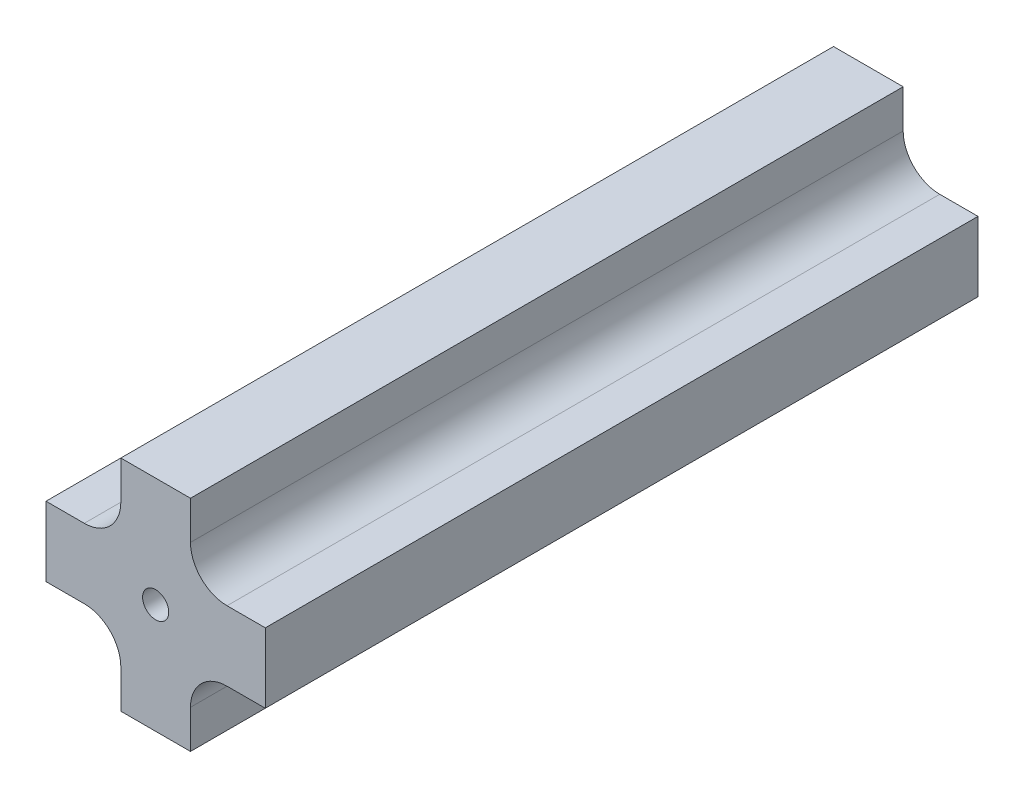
ISO-10303-21;
HEADER;
FILE_DESCRIPTION(('STEP AP214'),'2;1');
FILE_NAME('part.step','',(''),(''),'','','');
FILE_SCHEMA(('AUTOMOTIVE_DESIGN { 1 0 10303 214 1 1 1 1 }'));
ENDSEC;
DATA;
#1=APPLICATION_CONTEXT('core data for automotive mechanical design processes');
#2=APPLICATION_PROTOCOL_DEFINITION('international standard','automotive_design',2000,#1);
#3=PRODUCT_CONTEXT('',#1,'mechanical');
#4=PRODUCT('Part','Part','',(#3));
#5=PRODUCT_RELATED_PRODUCT_CATEGORY('part','',(#4));
#6=PRODUCT_DEFINITION_FORMATION('','',#4);
#7=PRODUCT_DEFINITION_CONTEXT('part definition',#1,'design');
#8=PRODUCT_DEFINITION('design','',#6,#7);
#9=PRODUCT_DEFINITION_SHAPE('','',#8);
#10=(LENGTH_UNIT() NAMED_UNIT(*) SI_UNIT(.MILLI.,.METRE.));
#11=(NAMED_UNIT(*) PLANE_ANGLE_UNIT() SI_UNIT($,.RADIAN.));
#12=(NAMED_UNIT(*) SI_UNIT($,.STERADIAN.) SOLID_ANGLE_UNIT());
#13=UNCERTAINTY_MEASURE_WITH_UNIT(LENGTH_MEASURE(1.E-05),#10,'distance_accuracy_value','');
#14=(GEOMETRIC_REPRESENTATION_CONTEXT(3) GLOBAL_UNCERTAINTY_ASSIGNED_CONTEXT((#13)) GLOBAL_UNIT_ASSIGNED_CONTEXT((#10,
#11,#12)) REPRESENTATION_CONTEXT('',''));
#15=CARTESIAN_POINT('',(0.,0.,0.));
#16=DIRECTION('',(0.,0.,1.));
#17=DIRECTION('',(1.,0.,0.));
#18=AXIS2_PLACEMENT_3D('',#15,#16,#17);
#19=CARTESIAN_POINT('',(26.0427427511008,-26.0427427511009,260.));
#20=DIRECTION('',(0.,0.,1.));
#21=DIRECTION('',(1.,0.,0.));
#22=AXIS2_PLACEMENT_3D('',#19,#20,#21);
#23=PLANE('',#22);
#24=CARTESIAN_POINT('',(26.0427427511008,-26.0427427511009,260.));
#25=DIRECTION('',(0.,0.,-1.));
#26=DIRECTION('',(1.,0.,0.));
#27=AXIS2_PLACEMENT_3D('',#24,#25,#26);
#28=CIRCLE('',#27,13.3358602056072);
#29=CARTESIAN_POINT('',(12.706882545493,-26.0427427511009,260.));
#30=VERTEX_POINT('',#29);
#31=CARTESIAN_POINT('',(26.0427427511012,-12.7068825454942,260.));
#32=VERTEX_POINT('',#31);
#33=EDGE_CURVE('E207',#30,#32,#28,.T.);
#34=ORIENTED_EDGE('',*,*,#33,.T.);
#35=DIRECTION('',(1.,0.,0.));
#36=VECTOR('',#35,1.);
#37=CARTESIAN_POINT('',(26.0427427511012,-12.7068825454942,260.));
#38=LINE('',#37,#36);
#39=CARTESIAN_POINT('',(40.005,-12.7068825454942,260.));
#40=VERTEX_POINT('',#39);
#41=EDGE_CURVE('E115',#32,#40,#38,.T.);
#42=ORIENTED_EDGE('',*,*,#41,.T.);
#43=DIRECTION('',(0.,1.,0.));
#44=VECTOR('',#43,1.);
#45=CARTESIAN_POINT('',(40.005,-12.7068825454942,260.));
#46=LINE('',#45,#44);
#47=CARTESIAN_POINT('',(40.005,12.7068825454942,260.));
#48=VERTEX_POINT('',#47);
#49=EDGE_CURVE('E246',#40,#48,#46,.T.);
#50=ORIENTED_EDGE('',*,*,#49,.T.);
#51=DIRECTION('',(-1.,0.,0.));
#52=VECTOR('',#51,1.);
#53=CARTESIAN_POINT('',(40.005,12.7068825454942,260.));
#54=LINE('',#53,#52);
#55=CARTESIAN_POINT('',(26.0427427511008,12.7068825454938,260.));
#56=VERTEX_POINT('',#55);
#57=EDGE_CURVE('E265',#48,#56,#54,.T.);
#58=ORIENTED_EDGE('',*,*,#57,.T.);
#59=CARTESIAN_POINT('',(26.0427427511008,26.0427427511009,260.));
#60=DIRECTION('',(0.,0.,-1.));
#61=DIRECTION('',(1.,0.,0.));
#62=AXIS2_PLACEMENT_3D('',#59,#60,#61);
#63=CIRCLE('',#62,13.3358602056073);
#64=CARTESIAN_POINT('',(12.7068825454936,26.0427427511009,260.));
#65=VERTEX_POINT('',#64);
#66=EDGE_CURVE('E262',#56,#65,#63,.T.);
#67=ORIENTED_EDGE('',*,*,#66,.T.);
#68=DIRECTION('',(0.,1.,0.));
#69=VECTOR('',#68,1.);
#70=CARTESIAN_POINT('',(12.7068825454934,26.0427427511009,260.));
#71=LINE('',#70,#69);
#72=CARTESIAN_POINT('',(12.7068825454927,40.005,260.));
#73=VERTEX_POINT('',#72);
#74=EDGE_CURVE('E264',#65,#73,#71,.T.);
#75=ORIENTED_EDGE('',*,*,#74,.T.);
#76=DIRECTION('',(-1.,0.,0.));
#77=VECTOR('',#76,1.);
#78=CARTESIAN_POINT('',(12.7068825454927,40.005,260.));
#79=LINE('',#78,#77);
#80=CARTESIAN_POINT('',(-12.7068825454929,40.005,260.));
#81=VERTEX_POINT('',#80);
#82=EDGE_CURVE('E267',#73,#81,#79,.T.);
#83=ORIENTED_EDGE('',*,*,#82,.T.);
#84=DIRECTION('',(0.,-1.,0.));
#85=VECTOR('',#84,1.);
#86=CARTESIAN_POINT('',(-12.7068825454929,40.005,260.));
#87=LINE('',#86,#85);
#88=CARTESIAN_POINT('',(-12.7068825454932,26.0427427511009,260.));
#89=VERTEX_POINT('',#88);
#90=EDGE_CURVE('E273',#81,#89,#87,.T.);
#91=ORIENTED_EDGE('',*,*,#90,.T.);
#92=CARTESIAN_POINT('',(-26.042742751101,26.0427427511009,260.));
#93=DIRECTION('',(0.,0.,-1.));
#94=DIRECTION('',(1.,0.,0.));
#95=AXIS2_PLACEMENT_3D('',#92,#93,#94);
#96=CIRCLE('',#95,13.3358602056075);
#97=CARTESIAN_POINT('',(-26.042742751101,12.7068825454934,260.));
#98=VERTEX_POINT('',#97);
#99=EDGE_CURVE('E275',#89,#98,#96,.T.);
#100=ORIENTED_EDGE('',*,*,#99,.T.);
#101=DIRECTION('',(-1.,0.,0.));
#102=VECTOR('',#101,1.);
#103=CARTESIAN_POINT('',(-26.042742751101,12.7068825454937,260.));
#104=LINE('',#103,#102);
#105=CARTESIAN_POINT('',(-40.005,12.7068825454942,260.));
#106=VERTEX_POINT('',#105);
#107=EDGE_CURVE('E277',#98,#106,#104,.T.);
#108=ORIENTED_EDGE('',*,*,#107,.T.);
#109=DIRECTION('',(0.,-1.,0.));
#110=VECTOR('',#109,1.);
#111=CARTESIAN_POINT('',(-40.005,12.7068825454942,260.));
#112=LINE('',#111,#110);
#113=CARTESIAN_POINT('',(-40.005,-12.7068825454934,260.));
#114=VERTEX_POINT('',#113);
#115=EDGE_CURVE('E279',#106,#114,#112,.T.);
#116=ORIENTED_EDGE('',*,*,#115,.T.);
#117=DIRECTION('',(1.,0.,0.));
#118=VECTOR('',#117,1.);
#119=CARTESIAN_POINT('',(-40.005,-12.7068825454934,260.));
#120=LINE('',#119,#118);
#121=CARTESIAN_POINT('',(-26.042742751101,-12.7068825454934,260.));
#122=VERTEX_POINT('',#121);
#123=EDGE_CURVE('E281',#114,#122,#120,.T.);
#124=ORIENTED_EDGE('',*,*,#123,.T.);
#125=CARTESIAN_POINT('',(-26.042742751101,-26.0427427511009,260.));
#126=DIRECTION('',(0.,0.,-1.));
#127=DIRECTION('',(1.,0.,0.));
#128=AXIS2_PLACEMENT_3D('',#125,#126,#127);
#129=CIRCLE('',#128,13.3358602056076);
#130=CARTESIAN_POINT('',(-12.7068825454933,-26.0427427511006,260.));
#131=VERTEX_POINT('',#130);
#132=EDGE_CURVE('E158',#122,#131,#129,.T.);
#133=ORIENTED_EDGE('',*,*,#132,.T.);
#134=DIRECTION('',(0.,-1.,0.));
#135=VECTOR('',#134,1.);
#136=CARTESIAN_POINT('',(-12.7068825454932,-26.0427427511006,260.));
#137=LINE('',#136,#135);
#138=CARTESIAN_POINT('',(-12.7068825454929,-40.005,260.));
#139=VERTEX_POINT('',#138);
#140=EDGE_CURVE('E152',#131,#139,#137,.T.);
#141=ORIENTED_EDGE('',*,*,#140,.T.);
#142=DIRECTION('',(1.,0.,0.));
#143=VECTOR('',#142,1.);
#144=CARTESIAN_POINT('',(-12.7068825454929,-40.005,260.));
#145=LINE('',#144,#143);
#146=CARTESIAN_POINT('',(12.7068825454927,-40.005,260.));
#147=VERTEX_POINT('',#146);
#148=EDGE_CURVE('E156',#139,#147,#145,.T.);
#149=ORIENTED_EDGE('',*,*,#148,.T.);
#150=DIRECTION('',(0.,1.,0.));
#151=VECTOR('',#150,1.);
#152=CARTESIAN_POINT('',(12.7068825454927,-40.005,260.));
#153=LINE('',#152,#151);
#154=EDGE_CURVE('E48',#147,#30,#153,.T.);
#155=ORIENTED_EDGE('',*,*,#154,.T.);
#156=EDGE_LOOP('',(#34,#42,#50,#58,#67,#75,#83,#91,#100,#108,#116,#124,#133,#141,#149,#155));
#157=FACE_BOUND('',#156,.T.);
#158=CARTESIAN_POINT('',(0.,0.,260.));
#159=DIRECTION('',(0.,0.,1.));
#160=DIRECTION('',(1.,0.,0.));
#161=AXIS2_PLACEMENT_3D('',#158,#159,#160);
#162=CIRCLE('',#161,4.7625);
#163=CARTESIAN_POINT('',(4.7625,0.,260.));
#164=VERTEX_POINT('',#163);
#165=EDGE_CURVE('E180',#164,#164,#162,.T.);
#166=ORIENTED_EDGE('',*,*,#165,.F.);
#167=EDGE_LOOP('',(#166));
#168=FACE_BOUND('',#167,.T.);
#169=ADVANCED_FACE('F31',(#157,#168),#23,.T.);
#170=CARTESIAN_POINT('',(26.0427427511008,-26.0427427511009,0.));
#171=DIRECTION('',(0.,0.,1.));
#172=DIRECTION('',(1.,0.,0.));
#173=AXIS2_PLACEMENT_3D('',#170,#171,#172);
#174=PLANE('',#173);
#175=CARTESIAN_POINT('',(26.0427427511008,-26.0427427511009,0.));
#176=DIRECTION('',(0.,0.,-1.));
#177=DIRECTION('',(1.,0.,0.));
#178=AXIS2_PLACEMENT_3D('',#175,#176,#177);
#179=CIRCLE('',#178,13.3358602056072);
#180=CARTESIAN_POINT('',(12.706882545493,-26.0427427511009,0.));
#181=VERTEX_POINT('',#180);
#182=CARTESIAN_POINT('',(26.0427427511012,-12.7068825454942,0.));
#183=VERTEX_POINT('',#182);
#184=EDGE_CURVE('E176',#181,#183,#179,.T.);
#185=ORIENTED_EDGE('',*,*,#184,.F.);
#186=DIRECTION('',(0.,1.,0.));
#187=VECTOR('',#186,1.);
#188=CARTESIAN_POINT('',(12.7068825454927,-40.005,0.));
#189=LINE('',#188,#187);
#190=CARTESIAN_POINT('',(12.7068825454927,-40.005,0.));
#191=VERTEX_POINT('',#190);
#192=EDGE_CURVE('E107',#191,#181,#189,.T.);
#193=ORIENTED_EDGE('',*,*,#192,.F.);
#194=DIRECTION('',(1.,0.,0.));
#195=VECTOR('',#194,1.);
#196=CARTESIAN_POINT('',(-12.7068825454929,-40.005,0.));
#197=LINE('',#196,#195);
#198=CARTESIAN_POINT('',(-12.7068825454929,-40.005,0.));
#199=VERTEX_POINT('',#198);
#200=EDGE_CURVE('E101',#199,#191,#197,.T.);
#201=ORIENTED_EDGE('',*,*,#200,.F.);
#202=DIRECTION('',(0.,-1.,0.));
#203=VECTOR('',#202,1.);
#204=CARTESIAN_POINT('',(-12.7068825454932,-26.0427427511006,0.));
#205=LINE('',#204,#203);
#206=CARTESIAN_POINT('',(-12.7068825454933,-26.0427427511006,0.));
#207=VERTEX_POINT('',#206);
#208=EDGE_CURVE('E166',#207,#199,#205,.T.);
#209=ORIENTED_EDGE('',*,*,#208,.F.);
#210=CARTESIAN_POINT('',(-26.042742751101,-26.0427427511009,0.));
#211=DIRECTION('',(0.,0.,-1.));
#212=DIRECTION('',(1.,0.,0.));
#213=AXIS2_PLACEMENT_3D('',#210,#211,#212);
#214=CIRCLE('',#213,13.3358602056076);
#215=CARTESIAN_POINT('',(-26.042742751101,-12.7068825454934,0.));
#216=VERTEX_POINT('',#215);
#217=EDGE_CURVE('E202',#216,#207,#214,.T.);
#218=ORIENTED_EDGE('',*,*,#217,.F.);
#219=DIRECTION('',(1.,0.,0.));
#220=VECTOR('',#219,1.);
#221=CARTESIAN_POINT('',(-40.005,-12.7068825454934,0.));
#222=LINE('',#221,#220);
#223=CARTESIAN_POINT('',(-40.005,-12.7068825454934,0.));
#224=VERTEX_POINT('',#223);
#225=EDGE_CURVE('E200',#224,#216,#222,.T.);
#226=ORIENTED_EDGE('',*,*,#225,.F.);
#227=DIRECTION('',(0.,-1.,0.));
#228=VECTOR('',#227,1.);
#229=CARTESIAN_POINT('',(-40.005,12.7068825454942,0.));
#230=LINE('',#229,#228);
#231=CARTESIAN_POINT('',(-40.005,12.7068825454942,0.));
#232=VERTEX_POINT('',#231);
#233=EDGE_CURVE('E198',#232,#224,#230,.T.);
#234=ORIENTED_EDGE('',*,*,#233,.F.);
#235=DIRECTION('',(-1.,0.,0.));
#236=VECTOR('',#235,1.);
#237=CARTESIAN_POINT('',(-26.042742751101,12.7068825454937,0.));
#238=LINE('',#237,#236);
#239=CARTESIAN_POINT('',(-26.042742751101,12.7068825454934,0.));
#240=VERTEX_POINT('',#239);
#241=EDGE_CURVE('E196',#240,#232,#238,.T.);
#242=ORIENTED_EDGE('',*,*,#241,.F.);
#243=CARTESIAN_POINT('',(-26.042742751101,26.0427427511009,0.));
#244=DIRECTION('',(0.,0.,-1.));
#245=DIRECTION('',(1.,0.,0.));
#246=AXIS2_PLACEMENT_3D('',#243,#244,#245);
#247=CIRCLE('',#246,13.3358602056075);
#248=CARTESIAN_POINT('',(-12.7068825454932,26.0427427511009,0.));
#249=VERTEX_POINT('',#248);
#250=EDGE_CURVE('E194',#249,#240,#247,.T.);
#251=ORIENTED_EDGE('',*,*,#250,.F.);
#252=DIRECTION('',(0.,-1.,0.));
#253=VECTOR('',#252,1.);
#254=CARTESIAN_POINT('',(-12.7068825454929,40.005,0.));
#255=LINE('',#254,#253);
#256=CARTESIAN_POINT('',(-12.7068825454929,40.005,0.));
#257=VERTEX_POINT('',#256);
#258=EDGE_CURVE('E192',#257,#249,#255,.T.);
#259=ORIENTED_EDGE('',*,*,#258,.F.);
#260=DIRECTION('',(-1.,0.,0.));
#261=VECTOR('',#260,1.);
#262=CARTESIAN_POINT('',(12.7068825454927,40.005,0.));
#263=LINE('',#262,#261);
#264=CARTESIAN_POINT('',(12.7068825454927,40.005,0.));
#265=VERTEX_POINT('',#264);
#266=EDGE_CURVE('E190',#265,#257,#263,.T.);
#267=ORIENTED_EDGE('',*,*,#266,.F.);
#268=DIRECTION('',(0.,1.,0.));
#269=VECTOR('',#268,1.);
#270=CARTESIAN_POINT('',(12.7068825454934,26.0427427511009,0.));
#271=LINE('',#270,#269);
#272=CARTESIAN_POINT('',(12.7068825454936,26.0427427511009,0.));
#273=VERTEX_POINT('',#272);
#274=EDGE_CURVE('E188',#273,#265,#271,.T.);
#275=ORIENTED_EDGE('',*,*,#274,.F.);
#276=CARTESIAN_POINT('',(26.0427427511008,26.0427427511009,0.));
#277=DIRECTION('',(0.,0.,-1.));
#278=DIRECTION('',(1.,0.,0.));
#279=AXIS2_PLACEMENT_3D('',#276,#277,#278);
#280=CIRCLE('',#279,13.3358602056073);
#281=CARTESIAN_POINT('',(26.0427427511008,12.7068825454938,0.));
#282=VERTEX_POINT('',#281);
#283=EDGE_CURVE('E186',#282,#273,#280,.T.);
#284=ORIENTED_EDGE('',*,*,#283,.F.);
#285=DIRECTION('',(-1.,0.,0.));
#286=VECTOR('',#285,1.);
#287=CARTESIAN_POINT('',(40.005,12.7068825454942,0.));
#288=LINE('',#287,#286);
#289=CARTESIAN_POINT('',(40.005,12.7068825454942,0.));
#290=VERTEX_POINT('',#289);
#291=EDGE_CURVE('E184',#290,#282,#288,.T.);
#292=ORIENTED_EDGE('',*,*,#291,.F.);
#293=DIRECTION('',(0.,1.,0.));
#294=VECTOR('',#293,1.);
#295=CARTESIAN_POINT('',(40.005,-12.7068825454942,0.));
#296=LINE('',#295,#294);
#297=CARTESIAN_POINT('',(40.005,-12.7068825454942,0.));
#298=VERTEX_POINT('',#297);
#299=EDGE_CURVE('E182',#298,#290,#296,.T.);
#300=ORIENTED_EDGE('',*,*,#299,.F.);
#301=DIRECTION('',(1.,0.,0.));
#302=VECTOR('',#301,1.);
#303=CARTESIAN_POINT('',(26.0427427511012,-12.7068825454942,0.));
#304=LINE('',#303,#302);
#305=EDGE_CURVE('E179',#183,#298,#304,.T.);
#306=ORIENTED_EDGE('',*,*,#305,.F.);
#307=EDGE_LOOP('',(#185,#193,#201,#209,#218,#226,#234,#242,#251,#259,#267,#275,#284,#292,#300,#306));
#308=FACE_BOUND('',#307,.T.);
#309=CARTESIAN_POINT('',(0.,0.,0.));
#310=DIRECTION('',(0.,0.,1.));
#311=DIRECTION('',(1.,0.,0.));
#312=AXIS2_PLACEMENT_3D('',#309,#310,#311);
#313=CIRCLE('',#312,4.7625);
#314=CARTESIAN_POINT('',(4.7625,0.,0.));
#315=VERTEX_POINT('',#314);
#316=EDGE_CURVE('E480',#315,#315,#313,.T.);
#317=ORIENTED_EDGE('',*,*,#316,.T.);
#318=EDGE_LOOP('',(#317));
#319=FACE_BOUND('',#318,.T.);
#320=ADVANCED_FACE('F250',(#308,#319),#174,.F.);
#321=CARTESIAN_POINT('',(26.0427427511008,-26.0427427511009,260.));
#322=DIRECTION('',(0.,0.,-1.));
#323=DIRECTION('',(-1.,0.,0.));
#324=AXIS2_PLACEMENT_3D('',#321,#322,#323);
#325=CYLINDRICAL_SURFACE('',#324,13.3358602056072);
#326=ORIENTED_EDGE('',*,*,#184,.T.);
#327=DIRECTION('',(0.,0.,-1.));
#328=VECTOR('',#327,1.);
#329=CARTESIAN_POINT('',(26.0427427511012,-12.7068825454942,260.));
#330=LINE('',#329,#328);
#331=EDGE_CURVE('E11',#32,#183,#330,.T.);
#332=ORIENTED_EDGE('',*,*,#331,.F.);
#333=ORIENTED_EDGE('',*,*,#33,.F.);
#334=DIRECTION('',(0.,0.,-1.));
#335=VECTOR('',#334,1.);
#336=CARTESIAN_POINT('',(12.706882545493,-26.0427427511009,260.));
#337=LINE('',#336,#335);
#338=EDGE_CURVE('E172',#30,#181,#337,.T.);
#339=ORIENTED_EDGE('',*,*,#338,.T.);
#340=EDGE_LOOP('',(#326,#332,#333,#339));
#341=FACE_BOUND('',#340,.T.);
#342=ADVANCED_FACE('F33',(#341),#325,.F.);
#343=CARTESIAN_POINT('',(26.0427427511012,-12.7068825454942,260.));
#344=DIRECTION('',(0.,1.,0.));
#345=DIRECTION('',(-1.,0.,0.));
#346=AXIS2_PLACEMENT_3D('',#343,#344,#345);
#347=PLANE('',#346);
#348=ORIENTED_EDGE('',*,*,#305,.T.);
#349=DIRECTION('',(0.,0.,-1.));
#350=VECTOR('',#349,1.);
#351=CARTESIAN_POINT('',(40.005,-12.7068825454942,260.));
#352=LINE('',#351,#350);
#353=EDGE_CURVE('E40',#40,#298,#352,.T.);
#354=ORIENTED_EDGE('',*,*,#353,.F.);
#355=ORIENTED_EDGE('',*,*,#41,.F.);
#356=ORIENTED_EDGE('',*,*,#331,.T.);
#357=EDGE_LOOP('',(#348,#354,#355,#356));
#358=FACE_BOUND('',#357,.T.);
#359=ADVANCED_FACE('F315',(#358),#347,.F.);
#360=CARTESIAN_POINT('',(40.005,-12.7068825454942,260.));
#361=DIRECTION('',(-1.,0.,0.));
#362=DIRECTION('',(0.,0.,1.));
#363=AXIS2_PLACEMENT_3D('',#360,#361,#362);
#364=PLANE('',#363);
#365=ORIENTED_EDGE('',*,*,#299,.T.);
#366=DIRECTION('',(0.,0.,-1.));
#367=VECTOR('',#366,1.);
#368=CARTESIAN_POINT('',(40.005,12.7068825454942,260.));
#369=LINE('',#368,#367);
#370=EDGE_CURVE('E238',#48,#290,#369,.T.);
#371=ORIENTED_EDGE('',*,*,#370,.F.);
#372=ORIENTED_EDGE('',*,*,#49,.F.);
#373=ORIENTED_EDGE('',*,*,#353,.T.);
#374=EDGE_LOOP('',(#365,#371,#372,#373));
#375=FACE_BOUND('',#374,.T.);
#376=ADVANCED_FACE('F244',(#375),#364,.F.);
#377=CARTESIAN_POINT('',(40.005,12.7068825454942,260.));
#378=DIRECTION('',(0.,-1.,0.));
#379=DIRECTION('',(1.,0.,0.));
#380=AXIS2_PLACEMENT_3D('',#377,#378,#379);
#381=PLANE('',#380);
#382=ORIENTED_EDGE('',*,*,#291,.T.);
#383=DIRECTION('',(0.,0.,-1.));
#384=VECTOR('',#383,1.);
#385=CARTESIAN_POINT('',(26.0427427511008,12.7068825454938,260.));
#386=LINE('',#385,#384);
#387=EDGE_CURVE('E235',#56,#282,#386,.T.);
#388=ORIENTED_EDGE('',*,*,#387,.F.);
#389=ORIENTED_EDGE('',*,*,#57,.F.);
#390=ORIENTED_EDGE('',*,*,#370,.T.);
#391=EDGE_LOOP('',(#382,#388,#389,#390));
#392=FACE_BOUND('',#391,.T.);
#393=ADVANCED_FACE('F256',(#392),#381,.F.);
#394=CARTESIAN_POINT('',(26.0427427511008,26.0427427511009,260.));
#395=DIRECTION('',(0.,0.,-1.));
#396=DIRECTION('',(-1.,0.,0.));
#397=AXIS2_PLACEMENT_3D('',#394,#395,#396);
#398=CYLINDRICAL_SURFACE('',#397,13.3358602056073);
#399=ORIENTED_EDGE('',*,*,#283,.T.);
#400=DIRECTION('',(0.,0.,-1.));
#401=VECTOR('',#400,1.);
#402=CARTESIAN_POINT('',(12.7068825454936,26.0427427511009,260.));
#403=LINE('',#402,#401);
#404=EDGE_CURVE('E232',#65,#273,#403,.T.);
#405=ORIENTED_EDGE('',*,*,#404,.F.);
#406=ORIENTED_EDGE('',*,*,#66,.F.);
#407=ORIENTED_EDGE('',*,*,#387,.T.);
#408=EDGE_LOOP('',(#399,#405,#406,#407));
#409=FACE_BOUND('',#408,.T.);
#410=ADVANCED_FACE('F260',(#409),#398,.F.);
#411=CARTESIAN_POINT('',(12.7068825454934,26.0427427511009,260.));
#412=DIRECTION('',(-1.,0.,0.));
#413=DIRECTION('',(0.,-1.,0.));
#414=AXIS2_PLACEMENT_3D('',#411,#412,#413);
#415=PLANE('',#414);
#416=ORIENTED_EDGE('',*,*,#274,.T.);
#417=DIRECTION('',(0.,0.,-1.));
#418=VECTOR('',#417,1.);
#419=CARTESIAN_POINT('',(12.7068825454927,40.005,260.));
#420=LINE('',#419,#418);
#421=EDGE_CURVE('E229',#73,#265,#420,.T.);
#422=ORIENTED_EDGE('',*,*,#421,.F.);
#423=ORIENTED_EDGE('',*,*,#74,.F.);
#424=ORIENTED_EDGE('',*,*,#404,.T.);
#425=EDGE_LOOP('',(#416,#422,#423,#424));
#426=FACE_BOUND('',#425,.T.);
#427=ADVANCED_FACE('F328',(#426),#415,.F.);
#428=CARTESIAN_POINT('',(12.7068825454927,40.005,260.));
#429=DIRECTION('',(0.,-1.,0.));
#430=DIRECTION('',(0.,0.,-1.));
#431=AXIS2_PLACEMENT_3D('',#428,#429,#430);
#432=PLANE('',#431);
#433=ORIENTED_EDGE('',*,*,#266,.T.);
#434=DIRECTION('',(0.,0.,-1.));
#435=VECTOR('',#434,1.);
#436=CARTESIAN_POINT('',(-12.7068825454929,40.005,260.));
#437=LINE('',#436,#435);
#438=EDGE_CURVE('E226',#81,#257,#437,.T.);
#439=ORIENTED_EDGE('',*,*,#438,.F.);
#440=ORIENTED_EDGE('',*,*,#82,.F.);
#441=ORIENTED_EDGE('',*,*,#421,.T.);
#442=EDGE_LOOP('',(#433,#439,#440,#441));
#443=FACE_BOUND('',#442,.T.);
#444=ADVANCED_FACE('F331',(#443),#432,.F.);
#445=CARTESIAN_POINT('',(-12.7068825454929,40.005,260.));
#446=DIRECTION('',(1.,0.,0.));
#447=DIRECTION('',(0.,1.,0.));
#448=AXIS2_PLACEMENT_3D('',#445,#446,#447);
#449=PLANE('',#448);
#450=ORIENTED_EDGE('',*,*,#258,.T.);
#451=DIRECTION('',(0.,0.,-1.));
#452=VECTOR('',#451,1.);
#453=CARTESIAN_POINT('',(-12.7068825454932,26.0427427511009,260.));
#454=LINE('',#453,#452);
#455=EDGE_CURVE('E223',#89,#249,#454,.T.);
#456=ORIENTED_EDGE('',*,*,#455,.F.);
#457=ORIENTED_EDGE('',*,*,#90,.F.);
#458=ORIENTED_EDGE('',*,*,#438,.T.);
#459=EDGE_LOOP('',(#450,#456,#457,#458));
#460=FACE_BOUND('',#459,.T.);
#461=ADVANCED_FACE('F335',(#460),#449,.F.);
#462=CARTESIAN_POINT('',(-26.042742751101,26.0427427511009,260.));
#463=DIRECTION('',(0.,0.,-1.));
#464=DIRECTION('',(-1.,0.,0.));
#465=AXIS2_PLACEMENT_3D('',#462,#463,#464);
#466=CYLINDRICAL_SURFACE('',#465,13.3358602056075);
#467=ORIENTED_EDGE('',*,*,#250,.T.);
#468=DIRECTION('',(0.,0.,-1.));
#469=VECTOR('',#468,1.);
#470=CARTESIAN_POINT('',(-26.042742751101,12.7068825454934,260.));
#471=LINE('',#470,#469);
#472=EDGE_CURVE('E220',#98,#240,#471,.T.);
#473=ORIENTED_EDGE('',*,*,#472,.F.);
#474=ORIENTED_EDGE('',*,*,#99,.F.);
#475=ORIENTED_EDGE('',*,*,#455,.T.);
#476=EDGE_LOOP('',(#467,#473,#474,#475));
#477=FACE_BOUND('',#476,.T.);
#478=ADVANCED_FACE('F339',(#477),#466,.F.);
#479=CARTESIAN_POINT('',(-26.042742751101,12.7068825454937,260.));
#480=DIRECTION('',(0.,-1.,0.));
#481=DIRECTION('',(1.,0.,0.));
#482=AXIS2_PLACEMENT_3D('',#479,#480,#481);
#483=PLANE('',#482);
#484=ORIENTED_EDGE('',*,*,#241,.T.);
#485=DIRECTION('',(0.,0.,-1.));
#486=VECTOR('',#485,1.);
#487=CARTESIAN_POINT('',(-40.005,12.7068825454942,260.));
#488=LINE('',#487,#486);
#489=EDGE_CURVE('E217',#106,#232,#488,.T.);
#490=ORIENTED_EDGE('',*,*,#489,.F.);
#491=ORIENTED_EDGE('',*,*,#107,.F.);
#492=ORIENTED_EDGE('',*,*,#472,.T.);
#493=EDGE_LOOP('',(#484,#490,#491,#492));
#494=FACE_BOUND('',#493,.T.);
#495=ADVANCED_FACE('F343',(#494),#483,.F.);
#496=CARTESIAN_POINT('',(-40.005,12.7068825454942,260.));
#497=DIRECTION('',(1.,0.,0.));
#498=DIRECTION('',(0.,0.,-1.));
#499=AXIS2_PLACEMENT_3D('',#496,#497,#498);
#500=PLANE('',#499);
#501=ORIENTED_EDGE('',*,*,#233,.T.);
#502=DIRECTION('',(0.,0.,-1.));
#503=VECTOR('',#502,1.);
#504=CARTESIAN_POINT('',(-40.005,-12.7068825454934,260.));
#505=LINE('',#504,#503);
#506=EDGE_CURVE('E214',#114,#224,#505,.T.);
#507=ORIENTED_EDGE('',*,*,#506,.F.);
#508=ORIENTED_EDGE('',*,*,#115,.F.);
#509=ORIENTED_EDGE('',*,*,#489,.T.);
#510=EDGE_LOOP('',(#501,#507,#508,#509));
#511=FACE_BOUND('',#510,.T.);
#512=ADVANCED_FACE('F347',(#511),#500,.F.);
#513=CARTESIAN_POINT('',(-40.005,-12.7068825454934,260.));
#514=DIRECTION('',(0.,1.,0.));
#515=DIRECTION('',(0.,0.,1.));
#516=AXIS2_PLACEMENT_3D('',#513,#514,#515);
#517=PLANE('',#516);
#518=ORIENTED_EDGE('',*,*,#225,.T.);
#519=DIRECTION('',(0.,0.,-1.));
#520=VECTOR('',#519,1.);
#521=CARTESIAN_POINT('',(-26.042742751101,-12.7068825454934,260.));
#522=LINE('',#521,#520);
#523=EDGE_CURVE('E211',#122,#216,#522,.T.);
#524=ORIENTED_EDGE('',*,*,#523,.F.);
#525=ORIENTED_EDGE('',*,*,#123,.F.);
#526=ORIENTED_EDGE('',*,*,#506,.T.);
#527=EDGE_LOOP('',(#518,#524,#525,#526));
#528=FACE_BOUND('',#527,.T.);
#529=ADVANCED_FACE('F287',(#528),#517,.F.);
#530=CARTESIAN_POINT('',(-26.042742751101,-26.0427427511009,260.));
#531=DIRECTION('',(0.,0.,-1.));
#532=DIRECTION('',(-1.,0.,0.));
#533=AXIS2_PLACEMENT_3D('',#530,#531,#532);
#534=CYLINDRICAL_SURFACE('',#533,13.3358602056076);
#535=ORIENTED_EDGE('',*,*,#217,.T.);
#536=DIRECTION('',(0.,0.,-1.));
#537=VECTOR('',#536,1.);
#538=CARTESIAN_POINT('',(-12.7068825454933,-26.0427427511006,260.));
#539=LINE('',#538,#537);
#540=EDGE_CURVE('E167',#131,#207,#539,.T.);
#541=ORIENTED_EDGE('',*,*,#540,.F.);
#542=ORIENTED_EDGE('',*,*,#132,.F.);
#543=ORIENTED_EDGE('',*,*,#523,.T.);
#544=EDGE_LOOP('',(#535,#541,#542,#543));
#545=FACE_BOUND('',#544,.T.);
#546=ADVANCED_FACE('F291',(#545),#534,.F.);
#547=CARTESIAN_POINT('',(-12.7068825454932,-26.0427427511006,260.));
#548=DIRECTION('',(1.,0.,0.));
#549=DIRECTION('',(0.,1.,0.));
#550=AXIS2_PLACEMENT_3D('',#547,#548,#549);
#551=PLANE('',#550);
#552=ORIENTED_EDGE('',*,*,#208,.T.);
#553=DIRECTION('',(0.,0.,-1.));
#554=VECTOR('',#553,1.);
#555=CARTESIAN_POINT('',(-12.7068825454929,-40.005,260.));
#556=LINE('',#555,#554);
#557=EDGE_CURVE('E163',#139,#199,#556,.T.);
#558=ORIENTED_EDGE('',*,*,#557,.F.);
#559=ORIENTED_EDGE('',*,*,#140,.F.);
#560=ORIENTED_EDGE('',*,*,#540,.T.);
#561=EDGE_LOOP('',(#552,#558,#559,#560));
#562=FACE_BOUND('',#561,.T.);
#563=ADVANCED_FACE('F164',(#562),#551,.F.);
#564=CARTESIAN_POINT('',(-12.7068825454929,-40.005,260.));
#565=DIRECTION('',(0.,1.,0.));
#566=DIRECTION('',(0.,0.,1.));
#567=AXIS2_PLACEMENT_3D('',#564,#565,#566);
#568=PLANE('',#567);
#569=ORIENTED_EDGE('',*,*,#200,.T.);
#570=DIRECTION('',(0.,0.,-1.));
#571=VECTOR('',#570,1.);
#572=CARTESIAN_POINT('',(12.7068825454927,-40.005,260.));
#573=LINE('',#572,#571);
#574=EDGE_CURVE('E168',#147,#191,#573,.T.);
#575=ORIENTED_EDGE('',*,*,#574,.F.);
#576=ORIENTED_EDGE('',*,*,#148,.F.);
#577=ORIENTED_EDGE('',*,*,#557,.T.);
#578=EDGE_LOOP('',(#569,#575,#576,#577));
#579=FACE_BOUND('',#578,.T.);
#580=ADVANCED_FACE('F170',(#579),#568,.F.);
#581=CARTESIAN_POINT('',(12.7068825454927,-40.005,260.));
#582=DIRECTION('',(-1.,0.,0.));
#583=DIRECTION('',(0.,-1.,0.));
#584=AXIS2_PLACEMENT_3D('',#581,#582,#583);
#585=PLANE('',#584);
#586=ORIENTED_EDGE('',*,*,#192,.T.);
#587=ORIENTED_EDGE('',*,*,#338,.F.);
#588=ORIENTED_EDGE('',*,*,#154,.F.);
#589=ORIENTED_EDGE('',*,*,#574,.T.);
#590=EDGE_LOOP('',(#586,#587,#588,#589));
#591=FACE_BOUND('',#590,.T.);
#592=ADVANCED_FACE('F295',(#591),#585,.F.);
#593=CARTESIAN_POINT('',(0.,0.,260.));
#594=DIRECTION('',(0.,0.,-1.));
#595=DIRECTION('',(-1.,0.,0.));
#596=AXIS2_PLACEMENT_3D('',#593,#594,#595);
#597=CYLINDRICAL_SURFACE('',#596,4.7625);
#598=ORIENTED_EDGE('',*,*,#165,.T.);
#599=EDGE_LOOP('',(#598));
#600=FACE_BOUND('',#599,.T.);
#601=ORIENTED_EDGE('',*,*,#316,.F.);
#602=EDGE_LOOP('',(#601));
#603=FACE_BOUND('',#602,.T.);
#604=ADVANCED_FACE('F297',(#600,#603),#597,.F.);
#605=CLOSED_SHELL('',(#169,#320,#342,#359,#376,#393,#410,#427,#444,#461,#478,#495,#512,#529,
#546,#563,#580,#592,#604));
#606=MANIFOLD_SOLID_BREP('B2',#605);
#607=ADVANCED_BREP_SHAPE_REPRESENTATION('',(#18,#606),#14);
#608=SHAPE_DEFINITION_REPRESENTATION(#9,#607);
ENDSEC;
END-ISO-10303-21;
